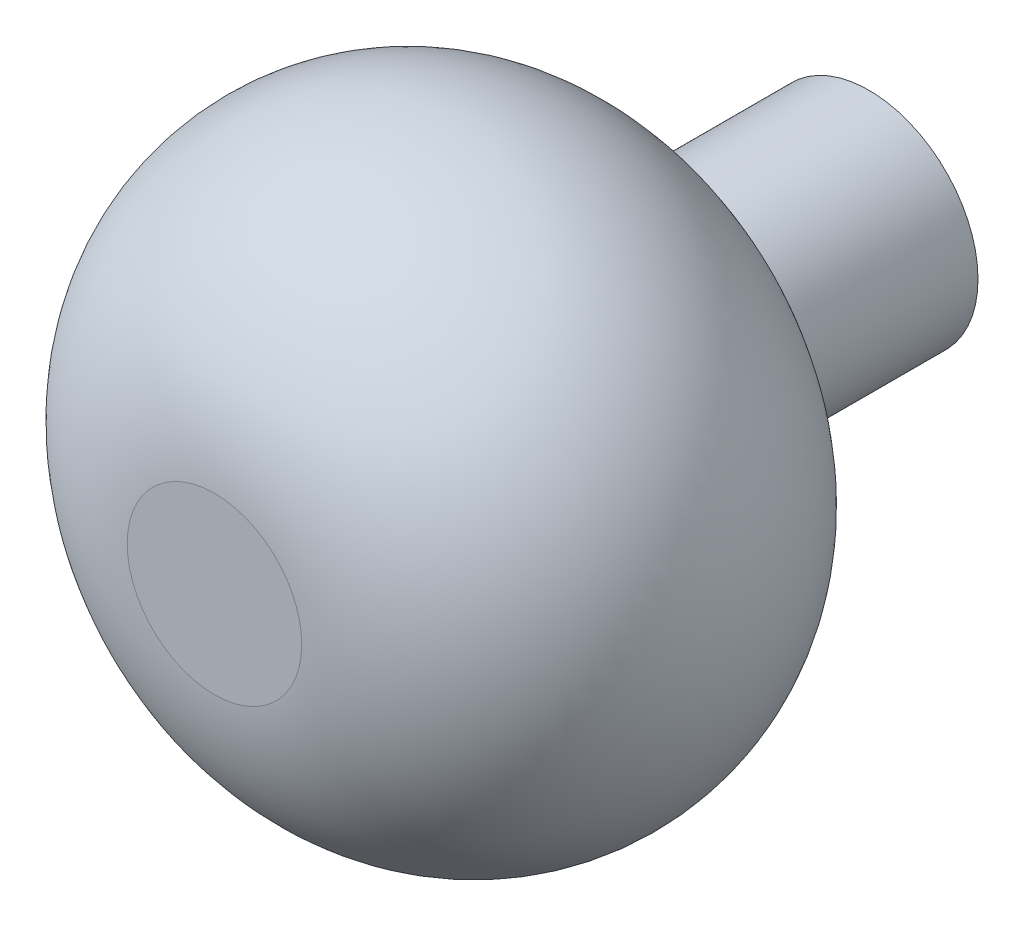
from build123d import *


with BuildPart() as part:
    # Sketch1 → Revolve1 (revolve)
    with BuildSketch(Plane(origin=(0, 0, 0), x_dir=(0, 0, -1), z_dir=(1, 0, 0)), mode=Mode.PRIVATE) as revolve1_sk:
        with BuildLine():
            Line((0, 0), (-38.1, 0))
            Line((-38.1, 0), (-38.1, 5.08))
            ThreePointArc((-38.1, 5.08), (-25.538493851, 17.520338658), (-11.835319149, 6.35))
            Line((-11.835319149, 6.35), (0, 6.35))
            Line((0, 6.35), (0, 0))
        make_face()
    revolve(revolve1_sk.sketch.rotate(Axis((0, 0, 0), (0, 0, 1)), 90), axis=Axis((0, 0, 0), (0, 0, 1)))


solid = part.part
